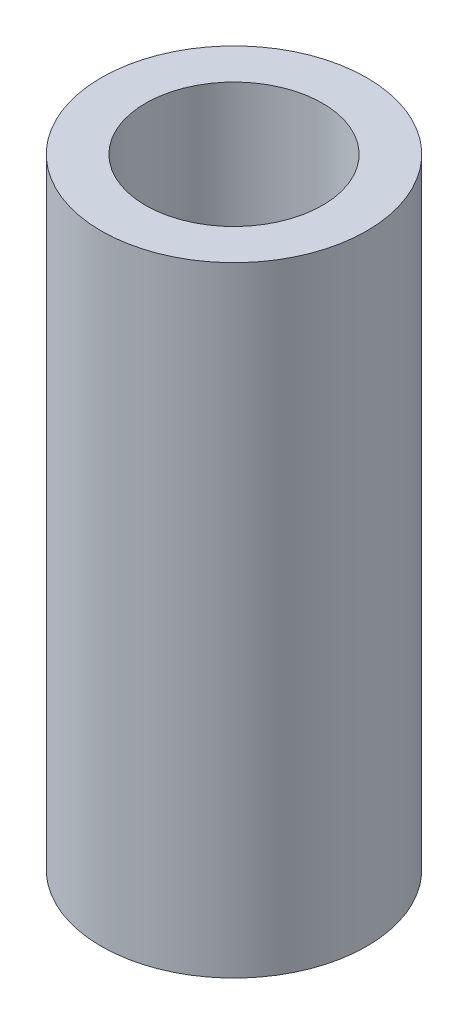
ISO-10303-21;
HEADER;
FILE_DESCRIPTION(('STEP AP214'),'2;1');
FILE_NAME('part.step','',(''),(''),'','','');
FILE_SCHEMA(('AUTOMOTIVE_DESIGN { 1 0 10303 214 1 1 1 1 }'));
ENDSEC;
DATA;
#1=APPLICATION_CONTEXT('core data for automotive mechanical design processes');
#2=APPLICATION_PROTOCOL_DEFINITION('international standard','automotive_design',2000,#1);
#3=PRODUCT_CONTEXT('',#1,'mechanical');
#4=PRODUCT('Part','Part','',(#3));
#5=PRODUCT_RELATED_PRODUCT_CATEGORY('part','',(#4));
#6=PRODUCT_DEFINITION_FORMATION('','',#4);
#7=PRODUCT_DEFINITION_CONTEXT('part definition',#1,'design');
#8=PRODUCT_DEFINITION('design','',#6,#7);
#9=PRODUCT_DEFINITION_SHAPE('','',#8);
#10=(LENGTH_UNIT() NAMED_UNIT(*) SI_UNIT(.MILLI.,.METRE.));
#11=(NAMED_UNIT(*) PLANE_ANGLE_UNIT() SI_UNIT($,.RADIAN.));
#12=(NAMED_UNIT(*) SI_UNIT($,.STERADIAN.) SOLID_ANGLE_UNIT());
#13=UNCERTAINTY_MEASURE_WITH_UNIT(LENGTH_MEASURE(1.E-05),#10,'distance_accuracy_value','');
#14=(GEOMETRIC_REPRESENTATION_CONTEXT(3) GLOBAL_UNCERTAINTY_ASSIGNED_CONTEXT((#13)) GLOBAL_UNIT_ASSIGNED_CONTEXT((#10,
#11,#12)) REPRESENTATION_CONTEXT('',''));
#15=CARTESIAN_POINT('',(0.,0.,0.));
#16=DIRECTION('',(0.,0.,1.));
#17=DIRECTION('',(1.,0.,0.));
#18=AXIS2_PLACEMENT_3D('',#15,#16,#17);
#19=CARTESIAN_POINT('',(0.,35.,0.));
#20=DIRECTION('',(0.,1.,0.));
#21=DIRECTION('',(0.,0.,1.));
#22=AXIS2_PLACEMENT_3D('',#19,#20,#21);
#23=PLANE('',#22);
#24=CARTESIAN_POINT('',(0.,35.,0.));
#25=DIRECTION('',(0.,1.,0.));
#26=DIRECTION('',(0.,0.,1.));
#27=AXIS2_PLACEMENT_3D('',#24,#25,#26);
#28=CIRCLE('',#27,7.5);
#29=CARTESIAN_POINT('',(0.,35.,7.5));
#30=VERTEX_POINT('',#29);
#31=EDGE_CURVE('E10',#30,#30,#28,.T.);
#32=ORIENTED_EDGE('',*,*,#31,.T.);
#33=EDGE_LOOP('',(#32));
#34=FACE_BOUND('',#33,.T.);
#35=CARTESIAN_POINT('',(0.,35.,0.));
#36=DIRECTION('',(0.,1.,0.));
#37=DIRECTION('',(0.,0.,1.));
#38=AXIS2_PLACEMENT_3D('',#35,#36,#37);
#39=CIRCLE('',#38,5.);
#40=CARTESIAN_POINT('',(0.,35.,5.));
#41=VERTEX_POINT('',#40);
#42=EDGE_CURVE('E44',#41,#41,#39,.T.);
#43=ORIENTED_EDGE('',*,*,#42,.F.);
#44=EDGE_LOOP('',(#43));
#45=FACE_BOUND('',#44,.T.);
#46=ADVANCED_FACE('F33',(#34,#45),#23,.T.);
#47=CARTESIAN_POINT('',(0.,0.,0.));
#48=DIRECTION('',(0.,1.,0.));
#49=DIRECTION('',(0.,0.,1.));
#50=AXIS2_PLACEMENT_3D('',#47,#48,#49);
#51=PLANE('',#50);
#52=CARTESIAN_POINT('',(0.,0.,0.));
#53=DIRECTION('',(0.,1.,0.));
#54=DIRECTION('',(0.,0.,1.));
#55=AXIS2_PLACEMENT_3D('',#52,#53,#54);
#56=CIRCLE('',#55,7.5);
#57=CARTESIAN_POINT('',(0.,0.,7.5));
#58=VERTEX_POINT('',#57);
#59=EDGE_CURVE('E37',#58,#58,#56,.T.);
#60=ORIENTED_EDGE('',*,*,#59,.F.);
#61=EDGE_LOOP('',(#60));
#62=FACE_BOUND('',#61,.T.);
#63=CARTESIAN_POINT('',(0.,0.,0.));
#64=DIRECTION('',(0.,1.,0.));
#65=DIRECTION('',(0.,0.,1.));
#66=AXIS2_PLACEMENT_3D('',#63,#64,#65);
#67=CIRCLE('',#66,5.);
#68=CARTESIAN_POINT('',(0.,0.,5.));
#69=VERTEX_POINT('',#68);
#70=EDGE_CURVE('E46',#69,#69,#67,.T.);
#71=ORIENTED_EDGE('',*,*,#70,.T.);
#72=EDGE_LOOP('',(#71));
#73=FACE_BOUND('',#72,.T.);
#74=ADVANCED_FACE('F56',(#62,#73),#51,.F.);
#75=CARTESIAN_POINT('',(0.,35.,0.));
#76=DIRECTION('',(0.,-1.,0.));
#77=DIRECTION('',(0.,0.,-1.));
#78=AXIS2_PLACEMENT_3D('',#75,#76,#77);
#79=CYLINDRICAL_SURFACE('',#78,7.5);
#80=ORIENTED_EDGE('',*,*,#31,.F.);
#81=EDGE_LOOP('',(#80));
#82=FACE_BOUND('',#81,.T.);
#83=ORIENTED_EDGE('',*,*,#59,.T.);
#84=EDGE_LOOP('',(#83));
#85=FACE_BOUND('',#84,.T.);
#86=ADVANCED_FACE('F35',(#82,#85),#79,.T.);
#87=CARTESIAN_POINT('',(0.,35.,0.));
#88=DIRECTION('',(0.,-1.,0.));
#89=DIRECTION('',(0.,0.,-1.));
#90=AXIS2_PLACEMENT_3D('',#87,#88,#89);
#91=CYLINDRICAL_SURFACE('',#90,5.);
#92=ORIENTED_EDGE('',*,*,#42,.T.);
#93=EDGE_LOOP('',(#92));
#94=FACE_BOUND('',#93,.T.);
#95=ORIENTED_EDGE('',*,*,#70,.F.);
#96=EDGE_LOOP('',(#95));
#97=FACE_BOUND('',#96,.T.);
#98=ADVANCED_FACE('F52',(#94,#97),#91,.F.);
#99=CLOSED_SHELL('',(#46,#74,#86,#98));
#100=MANIFOLD_SOLID_BREP('B2',#99);
#101=ADVANCED_BREP_SHAPE_REPRESENTATION('',(#18,#100),#14);
#102=SHAPE_DEFINITION_REPRESENTATION(#9,#101);
ENDSEC;
END-ISO-10303-21;
